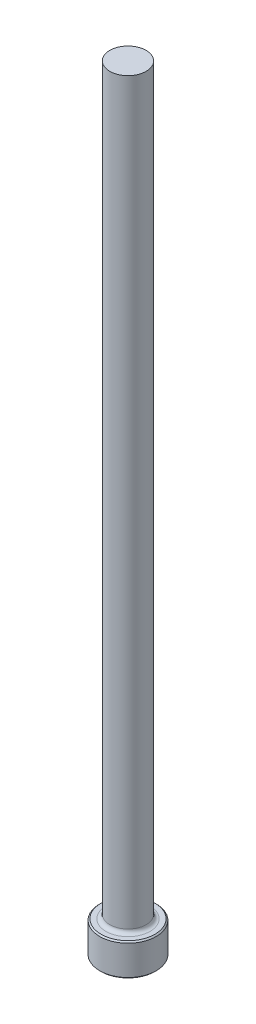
ISO-10303-21;
HEADER;
FILE_DESCRIPTION(('STEP AP214'),'2;1');
FILE_NAME('part.step','',(''),(''),'','','');
FILE_SCHEMA(('AUTOMOTIVE_DESIGN { 1 0 10303 214 1 1 1 1 }'));
ENDSEC;
DATA;
#1=APPLICATION_CONTEXT('core data for automotive mechanical design processes');
#2=APPLICATION_PROTOCOL_DEFINITION('international standard','automotive_design',2000,#1);
#3=PRODUCT_CONTEXT('',#1,'mechanical');
#4=PRODUCT('Part','Part','',(#3));
#5=PRODUCT_RELATED_PRODUCT_CATEGORY('part','',(#4));
#6=PRODUCT_DEFINITION_FORMATION('','',#4);
#7=PRODUCT_DEFINITION_CONTEXT('part definition',#1,'design');
#8=PRODUCT_DEFINITION('design','',#6,#7);
#9=PRODUCT_DEFINITION_SHAPE('','',#8);
#10=(LENGTH_UNIT() NAMED_UNIT(*) SI_UNIT(.MILLI.,.METRE.));
#11=(NAMED_UNIT(*) PLANE_ANGLE_UNIT() SI_UNIT($,.RADIAN.));
#12=(NAMED_UNIT(*) SI_UNIT($,.STERADIAN.) SOLID_ANGLE_UNIT());
#13=UNCERTAINTY_MEASURE_WITH_UNIT(LENGTH_MEASURE(1.E-05),#10,'distance_accuracy_value','');
#14=(GEOMETRIC_REPRESENTATION_CONTEXT(3) GLOBAL_UNCERTAINTY_ASSIGNED_CONTEXT((#13)) GLOBAL_UNIT_ASSIGNED_CONTEXT((#10,
#11,#12)) REPRESENTATION_CONTEXT('',''));
#15=CARTESIAN_POINT('',(0.,0.,0.));
#16=DIRECTION('',(0.,0.,1.));
#17=DIRECTION('',(1.,0.,0.));
#18=AXIS2_PLACEMENT_3D('',#15,#16,#17);
#19=CARTESIAN_POINT('',(0.,0.,0.));
#20=DIRECTION('',(0.,-1.,0.));
#21=DIRECTION('',(0.,0.,-1.));
#22=AXIS2_PLACEMENT_3D('',#19,#20,#21);
#23=PLANE('',#22);
#24=CARTESIAN_POINT('',(0.,0.,0.));
#25=DIRECTION('',(0.,-1.,0.));
#26=DIRECTION('',(0.,0.,-1.));
#27=AXIS2_PLACEMENT_3D('',#24,#25,#26);
#28=CIRCLE('',#27,5.29589999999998);
#29=CARTESIAN_POINT('',(0.,0.,-5.29589999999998));
#30=VERTEX_POINT('',#29);
#31=EDGE_CURVE('E46',#30,#30,#28,.T.);
#32=ORIENTED_EDGE('',*,*,#31,.T.);
#33=EDGE_LOOP('',(#32));
#34=FACE_BOUND('',#33,.T.);
#35=ADVANCED_FACE('F35',(#34),#23,.T.);
#36=CARTESIAN_POINT('',(0.,259.958771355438,0.));
#37=DIRECTION('',(0.,1.,0.));
#38=DIRECTION('',(0.,0.,1.));
#39=AXIS2_PLACEMENT_3D('',#36,#37,#38);
#40=CYLINDRICAL_SURFACE('',#39,5.54989999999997);
#41=CARTESIAN_POINT('',(0.,6.09599999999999,0.));
#42=DIRECTION('',(0.,1.,0.));
#43=DIRECTION('',(0.,0.,1.));
#44=AXIS2_PLACEMENT_3D('',#41,#42,#43);
#45=CIRCLE('',#44,5.54989999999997);
#46=CARTESIAN_POINT('',(0.,6.09599999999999,5.54989999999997));
#47=VERTEX_POINT('',#46);
#48=EDGE_CURVE('E50',#47,#47,#45,.F.);
#49=ORIENTED_EDGE('',*,*,#48,.T.);
#50=EDGE_LOOP('',(#49));
#51=FACE_BOUND('',#50,.T.);
#52=CARTESIAN_POINT('',(0.,0.253999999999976,0.));
#53=DIRECTION('',(0.,-1.,0.));
#54=DIRECTION('',(0.,0.,-1.));
#55=AXIS2_PLACEMENT_3D('',#52,#53,#54);
#56=CIRCLE('',#55,5.54989999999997);
#57=CARTESIAN_POINT('',(0.,0.253999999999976,-5.54989999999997));
#58=VERTEX_POINT('',#57);
#59=EDGE_CURVE('E55',#58,#58,#56,.F.);
#60=ORIENTED_EDGE('',*,*,#59,.T.);
#61=EDGE_LOOP('',(#60));
#62=FACE_BOUND('',#61,.T.);
#63=ADVANCED_FACE('F77',(#51,#62),#40,.T.);
#64=CARTESIAN_POINT('',(-5.54989999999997,6.35,0.));
#65=DIRECTION('',(0.,1.,0.));
#66=DIRECTION('',(0.,0.,1.));
#67=AXIS2_PLACEMENT_3D('',#64,#65,#66);
#68=PLANE('',#67);
#69=CARTESIAN_POINT('',(0.,6.35,0.));
#70=DIRECTION('',(0.,1.,0.));
#71=DIRECTION('',(0.,0.,1.));
#72=AXIS2_PLACEMENT_3D('',#69,#70,#71);
#73=CIRCLE('',#72,4.33323999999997);
#74=CARTESIAN_POINT('',(0.,6.35,4.33323999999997));
#75=VERTEX_POINT('',#74);
#76=EDGE_CURVE('E10',#75,#75,#73,.F.);
#77=ORIENTED_EDGE('',*,*,#76,.T.);
#78=EDGE_LOOP('',(#77));
#79=FACE_BOUND('',#78,.T.);
#80=CARTESIAN_POINT('',(0.,6.35,0.));
#81=DIRECTION('',(0.,1.,0.));
#82=DIRECTION('',(0.,0.,1.));
#83=AXIS2_PLACEMENT_3D('',#80,#81,#82);
#84=CIRCLE('',#83,5.29589999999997);
#85=CARTESIAN_POINT('',(0.,6.35,5.29589999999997));
#86=VERTEX_POINT('',#85);
#87=EDGE_CURVE('E58',#86,#86,#84,.T.);
#88=ORIENTED_EDGE('',*,*,#87,.T.);
#89=EDGE_LOOP('',(#88));
#90=FACE_BOUND('',#89,.T.);
#91=ADVANCED_FACE('F69',(#79,#90),#68,.T.);
#92=CARTESIAN_POINT('',(0.,259.958771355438,0.));
#93=DIRECTION('',(0.,1.,0.));
#94=DIRECTION('',(0.,0.,1.));
#95=AXIS2_PLACEMENT_3D('',#92,#93,#94);
#96=CYLINDRICAL_SURFACE('',#95,3.57123999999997);
#97=CARTESIAN_POINT('',(0.,7.11200000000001,0.));
#98=DIRECTION('',(0.,1.,0.));
#99=DIRECTION('',(0.,0.,1.));
#100=AXIS2_PLACEMENT_3D('',#97,#98,#99);
#101=CIRCLE('',#100,3.57123999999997);
#102=CARTESIAN_POINT('',(0.,7.11200000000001,3.57123999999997));
#103=VERTEX_POINT('',#102);
#104=EDGE_CURVE('E42',#103,#103,#101,.T.);
#105=ORIENTED_EDGE('',*,*,#104,.T.);
#106=EDGE_LOOP('',(#105));
#107=FACE_BOUND('',#106,.T.);
#108=CARTESIAN_POINT('',(0.,152.4,0.));
#109=DIRECTION('',(0.,1.,0.));
#110=DIRECTION('',(0.,0.,1.));
#111=AXIS2_PLACEMENT_3D('',#108,#109,#110);
#112=CIRCLE('',#111,3.57123999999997);
#113=CARTESIAN_POINT('',(0.,152.4,3.57123999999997));
#114=VERTEX_POINT('',#113);
#115=EDGE_CURVE('E61',#114,#114,#112,.T.);
#116=ORIENTED_EDGE('',*,*,#115,.F.);
#117=EDGE_LOOP('',(#116));
#118=FACE_BOUND('',#117,.T.);
#119=ADVANCED_FACE('F67',(#107,#118),#96,.T.);
#120=CARTESIAN_POINT('',(-3.57123999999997,152.4,0.));
#121=DIRECTION('',(0.,1.,0.));
#122=DIRECTION('',(0.,0.,1.));
#123=AXIS2_PLACEMENT_3D('',#120,#121,#122);
#124=PLANE('',#123);
#125=ORIENTED_EDGE('',*,*,#115,.T.);
#126=EDGE_LOOP('',(#125));
#127=FACE_BOUND('',#126,.T.);
#128=ADVANCED_FACE('F65',(#127),#124,.T.);
#129=CARTESIAN_POINT('',(0.,6.35000000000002,0.));
#130=DIRECTION('',(0.,-1.,0.));
#131=DIRECTION('',(0.,0.,-1.));
#132=AXIS2_PLACEMENT_3D('',#129,#130,#131);
#133=CONICAL_SURFACE('',#132,5.29589999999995,0.785398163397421);
#134=ORIENTED_EDGE('',*,*,#48,.F.);
#135=EDGE_LOOP('',(#134));
#136=FACE_BOUND('',#135,.T.);
#137=ORIENTED_EDGE('',*,*,#87,.F.);
#138=EDGE_LOOP('',(#137));
#139=FACE_BOUND('',#138,.T.);
#140=ADVANCED_FACE('F75',(#136,#139),#133,.T.);
#141=CARTESIAN_POINT('',(0.,0.253999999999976,0.));
#142=DIRECTION('',(0.,1.,0.));
#143=DIRECTION('',(0.,0.,1.));
#144=AXIS2_PLACEMENT_3D('',#141,#142,#143);
#145=CONICAL_SURFACE('',#144,5.54989999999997,0.785398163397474);
#146=ORIENTED_EDGE('',*,*,#31,.F.);
#147=EDGE_LOOP('',(#146));
#148=FACE_BOUND('',#147,.T.);
#149=ORIENTED_EDGE('',*,*,#59,.F.);
#150=EDGE_LOOP('',(#149));
#151=FACE_BOUND('',#150,.T.);
#152=ADVANCED_FACE('F89',(#148,#151),#145,.T.);
#153=CARTESIAN_POINT('',(0.,7.11200000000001,0.));
#154=DIRECTION('',(0.,1.,0.));
#155=DIRECTION('',(0.,0.,1.));
#156=AXIS2_PLACEMENT_3D('',#153,#154,#155);
#157=TOROIDAL_SURFACE('',#156,4.33323999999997,0.762);
#158=ORIENTED_EDGE('',*,*,#76,.F.);
#159=EDGE_LOOP('',(#158));
#160=FACE_BOUND('',#159,.T.);
#161=ORIENTED_EDGE('',*,*,#104,.F.);
#162=EDGE_LOOP('',(#161));
#163=FACE_BOUND('',#162,.T.);
#164=ADVANCED_FACE('F37',(#160,#163),#157,.F.);
#165=CLOSED_SHELL('',(#35,#63,#91,#119,#128,#140,#152,#164));
#166=MANIFOLD_SOLID_BREP('B2',#165);
#167=ADVANCED_BREP_SHAPE_REPRESENTATION('',(#18,#166),#14);
#168=SHAPE_DEFINITION_REPRESENTATION(#9,#167);
ENDSEC;
END-ISO-10303-21;
